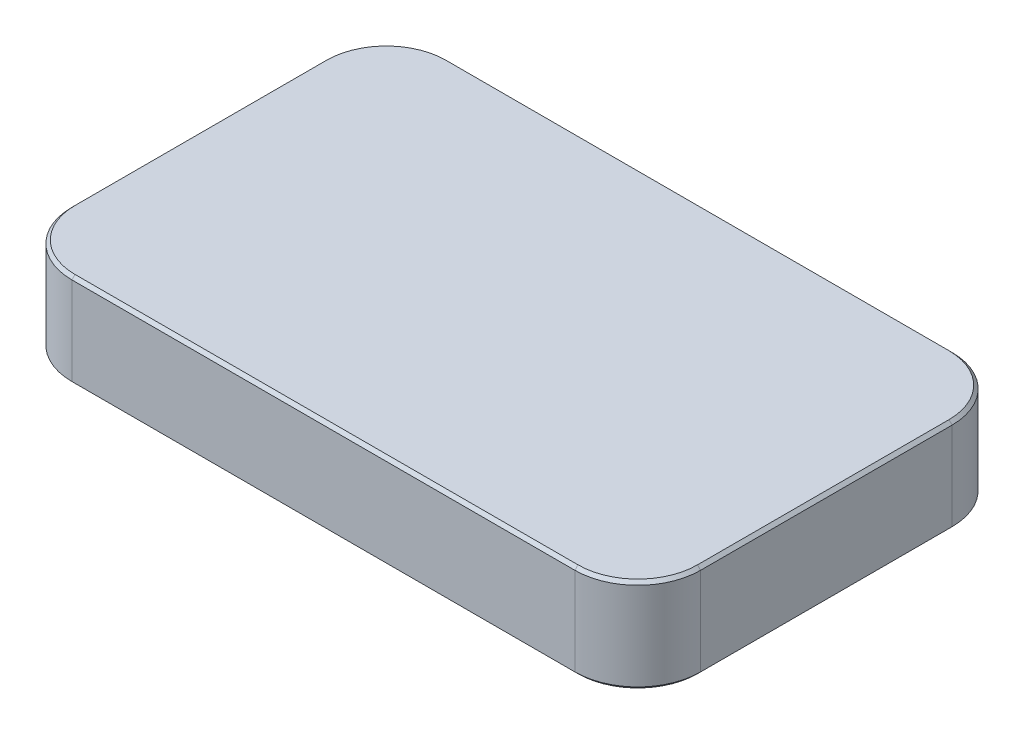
ISO-10303-21;
HEADER;
FILE_DESCRIPTION(('STEP AP214'),'2;1');
FILE_NAME('part.step','',(''),(''),'','','');
FILE_SCHEMA(('AUTOMOTIVE_DESIGN { 1 0 10303 214 1 1 1 1 }'));
ENDSEC;
DATA;
#1=APPLICATION_CONTEXT('core data for automotive mechanical design processes');
#2=APPLICATION_PROTOCOL_DEFINITION('international standard','automotive_design',2000,#1);
#3=PRODUCT_CONTEXT('',#1,'mechanical');
#4=PRODUCT('Part','Part','',(#3));
#5=PRODUCT_RELATED_PRODUCT_CATEGORY('part','',(#4));
#6=PRODUCT_DEFINITION_FORMATION('','',#4);
#7=PRODUCT_DEFINITION_CONTEXT('part definition',#1,'design');
#8=PRODUCT_DEFINITION('design','',#6,#7);
#9=PRODUCT_DEFINITION_SHAPE('','',#8);
#10=(LENGTH_UNIT() NAMED_UNIT(*) SI_UNIT(.MILLI.,.METRE.));
#11=(NAMED_UNIT(*) PLANE_ANGLE_UNIT() SI_UNIT($,.RADIAN.));
#12=(NAMED_UNIT(*) SI_UNIT($,.STERADIAN.) SOLID_ANGLE_UNIT());
#13=UNCERTAINTY_MEASURE_WITH_UNIT(LENGTH_MEASURE(1.E-05),#10,'distance_accuracy_value','');
#14=(GEOMETRIC_REPRESENTATION_CONTEXT(3) GLOBAL_UNCERTAINTY_ASSIGNED_CONTEXT((#13)) GLOBAL_UNIT_ASSIGNED_CONTEXT((#10,
#11,#12)) REPRESENTATION_CONTEXT('',''));
#15=CARTESIAN_POINT('',(0.,0.,0.));
#16=DIRECTION('',(0.,0.,1.));
#17=DIRECTION('',(1.,0.,0.));
#18=AXIS2_PLACEMENT_3D('',#15,#16,#17);
#19=CARTESIAN_POINT('',(-63.5,19.05,-38.1));
#20=DIRECTION('',(1.,0.,0.));
#21=DIRECTION('',(0.,0.,-1.));
#22=AXIS2_PLACEMENT_3D('',#19,#20,#21);
#23=PLANE('',#22);
#24=DIRECTION('',(0.,-1.,0.));
#25=VECTOR('',#24,1.);
#26=CARTESIAN_POINT('',(-63.5,19.05,-25.4));
#27=LINE('',#26,#25);
#28=CARTESIAN_POINT('',(-63.5,18.415,-25.4));
#29=VERTEX_POINT('',#28);
#30=CARTESIAN_POINT('',(-63.5,0.635000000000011,-25.4));
#31=VERTEX_POINT('',#30);
#32=EDGE_CURVE('E277',#29,#31,#27,.T.);
#33=ORIENTED_EDGE('',*,*,#32,.T.);
#34=DIRECTION('',(0.,0.,1.));
#35=VECTOR('',#34,1.);
#36=CARTESIAN_POINT('',(-63.5,0.635000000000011,-38.1));
#37=LINE('',#36,#35);
#38=CARTESIAN_POINT('',(-63.5,0.635000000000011,25.4));
#39=VERTEX_POINT('',#38);
#40=EDGE_CURVE('E205',#31,#39,#37,.T.);
#41=ORIENTED_EDGE('',*,*,#40,.T.);
#42=DIRECTION('',(0.,-1.,0.));
#43=VECTOR('',#42,1.);
#44=CARTESIAN_POINT('',(-63.5,19.05,25.4));
#45=LINE('',#44,#43);
#46=CARTESIAN_POINT('',(-63.5,18.415,25.4));
#47=VERTEX_POINT('',#46);
#48=EDGE_CURVE('E236',#39,#47,#45,.F.);
#49=ORIENTED_EDGE('',*,*,#48,.T.);
#50=DIRECTION('',(0.,0.,-1.));
#51=VECTOR('',#50,1.);
#52=CARTESIAN_POINT('',(-63.5,18.415,-25.4));
#53=LINE('',#52,#51);
#54=EDGE_CURVE('E203',#47,#29,#53,.T.);
#55=ORIENTED_EDGE('',*,*,#54,.T.);
#56=EDGE_LOOP('',(#33,#41,#49,#55));
#57=FACE_BOUND('',#56,.T.);
#58=ADVANCED_FACE('F31',(#57),#23,.F.);
#59=CARTESIAN_POINT('',(-63.5,19.05,38.1));
#60=DIRECTION('',(0.,0.,-1.));
#61=DIRECTION('',(-1.,0.,0.));
#62=AXIS2_PLACEMENT_3D('',#59,#60,#61);
#63=PLANE('',#62);
#64=DIRECTION('',(0.,-1.,0.));
#65=VECTOR('',#64,1.);
#66=CARTESIAN_POINT('',(-50.8,19.05,38.1));
#67=LINE('',#66,#65);
#68=CARTESIAN_POINT('',(-50.8,18.415,38.1));
#69=VERTEX_POINT('',#68);
#70=CARTESIAN_POINT('',(-50.8,0.635000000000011,38.1));
#71=VERTEX_POINT('',#70);
#72=EDGE_CURVE('E164',#69,#71,#67,.T.);
#73=ORIENTED_EDGE('',*,*,#72,.T.);
#74=DIRECTION('',(1.,0.,0.));
#75=VECTOR('',#74,1.);
#76=CARTESIAN_POINT('',(-63.5,0.635000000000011,38.1));
#77=LINE('',#76,#75);
#78=CARTESIAN_POINT('',(50.8,0.635000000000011,38.1));
#79=VERTEX_POINT('',#78);
#80=EDGE_CURVE('E180',#71,#79,#77,.T.);
#81=ORIENTED_EDGE('',*,*,#80,.T.);
#82=DIRECTION('',(0.,-1.,0.));
#83=VECTOR('',#82,1.);
#84=CARTESIAN_POINT('',(50.8,19.05,38.1));
#85=LINE('',#84,#83);
#86=CARTESIAN_POINT('',(50.8,18.415,38.1));
#87=VERTEX_POINT('',#86);
#88=EDGE_CURVE('E293',#79,#87,#85,.F.);
#89=ORIENTED_EDGE('',*,*,#88,.T.);
#90=DIRECTION('',(-1.,0.,0.));
#91=VECTOR('',#90,1.);
#92=CARTESIAN_POINT('',(-50.8,18.415,38.1));
#93=LINE('',#92,#91);
#94=EDGE_CURVE('E178',#87,#69,#93,.T.);
#95=ORIENTED_EDGE('',*,*,#94,.T.);
#96=EDGE_LOOP('',(#73,#81,#89,#95));
#97=FACE_BOUND('',#96,.T.);
#98=ADVANCED_FACE('F315',(#97),#63,.F.);
#99=CARTESIAN_POINT('',(63.5,19.05,-38.1));
#100=DIRECTION('',(-1.,0.,0.));
#101=DIRECTION('',(0.,0.,1.));
#102=AXIS2_PLACEMENT_3D('',#99,#100,#101);
#103=PLANE('',#102);
#104=DIRECTION('',(0.,-1.,0.));
#105=VECTOR('',#104,1.);
#106=CARTESIAN_POINT('',(63.5,19.05,25.4));
#107=LINE('',#106,#105);
#108=CARTESIAN_POINT('',(63.5,18.415,25.4));
#109=VERTEX_POINT('',#108);
#110=CARTESIAN_POINT('',(63.5,0.635000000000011,25.4));
#111=VERTEX_POINT('',#110);
#112=EDGE_CURVE('E287',#109,#111,#107,.T.);
#113=ORIENTED_EDGE('',*,*,#112,.T.);
#114=DIRECTION('',(0.,0.,-1.));
#115=VECTOR('',#114,1.);
#116=CARTESIAN_POINT('',(63.5,0.635000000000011,-38.1));
#117=LINE('',#116,#115);
#118=CARTESIAN_POINT('',(63.5,0.635000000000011,-25.4));
#119=VERTEX_POINT('',#118);
#120=EDGE_CURVE('E188',#111,#119,#117,.T.);
#121=ORIENTED_EDGE('',*,*,#120,.T.);
#122=DIRECTION('',(0.,-1.,0.));
#123=VECTOR('',#122,1.);
#124=CARTESIAN_POINT('',(63.5,19.05,-25.4));
#125=LINE('',#124,#123);
#126=CARTESIAN_POINT('',(63.5,18.415,-25.4));
#127=VERTEX_POINT('',#126);
#128=EDGE_CURVE('E290',#119,#127,#125,.F.);
#129=ORIENTED_EDGE('',*,*,#128,.T.);
#130=DIRECTION('',(0.,0.,1.));
#131=VECTOR('',#130,1.);
#132=CARTESIAN_POINT('',(63.5,18.415,25.4));
#133=LINE('',#132,#131);
#134=EDGE_CURVE('E186',#127,#109,#133,.T.);
#135=ORIENTED_EDGE('',*,*,#134,.T.);
#136=EDGE_LOOP('',(#113,#121,#129,#135));
#137=FACE_BOUND('',#136,.T.);
#138=ADVANCED_FACE('F359',(#137),#103,.F.);
#139=CARTESIAN_POINT('',(-63.5,19.05,-38.1));
#140=DIRECTION('',(0.,0.,1.));
#141=DIRECTION('',(1.,0.,0.));
#142=AXIS2_PLACEMENT_3D('',#139,#140,#141);
#143=PLANE('',#142);
#144=DIRECTION('',(0.,-1.,0.));
#145=VECTOR('',#144,1.);
#146=CARTESIAN_POINT('',(50.8,19.05,-38.1));
#147=LINE('',#146,#145);
#148=CARTESIAN_POINT('',(50.8,18.415,-38.1));
#149=VERTEX_POINT('',#148);
#150=CARTESIAN_POINT('',(50.8,0.635000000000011,-38.1));
#151=VERTEX_POINT('',#150);
#152=EDGE_CURVE('E279',#149,#151,#147,.T.);
#153=ORIENTED_EDGE('',*,*,#152,.T.);
#154=DIRECTION('',(-1.,0.,0.));
#155=VECTOR('',#154,1.);
#156=CARTESIAN_POINT('',(-63.5,0.635000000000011,-38.1));
#157=LINE('',#156,#155);
#158=CARTESIAN_POINT('',(-50.8,0.635000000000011,-38.1));
#159=VERTEX_POINT('',#158);
#160=EDGE_CURVE('E197',#151,#159,#157,.T.);
#161=ORIENTED_EDGE('',*,*,#160,.T.);
#162=DIRECTION('',(0.,-1.,0.));
#163=VECTOR('',#162,1.);
#164=CARTESIAN_POINT('',(-50.8,19.05,-38.1));
#165=LINE('',#164,#163);
#166=CARTESIAN_POINT('',(-50.8,18.415,-38.1));
#167=VERTEX_POINT('',#166);
#168=EDGE_CURVE('E284',#159,#167,#165,.F.);
#169=ORIENTED_EDGE('',*,*,#168,.T.);
#170=DIRECTION('',(1.,0.,0.));
#171=VECTOR('',#170,1.);
#172=CARTESIAN_POINT('',(50.8,18.415,-38.1));
#173=LINE('',#172,#171);
#174=EDGE_CURVE('E195',#167,#149,#173,.T.);
#175=ORIENTED_EDGE('',*,*,#174,.T.);
#176=EDGE_LOOP('',(#153,#161,#169,#175));
#177=FACE_BOUND('',#176,.T.);
#178=ADVANCED_FACE('F343',(#177),#143,.F.);
#179=CARTESIAN_POINT('',(-63.5,19.05,38.1));
#180=DIRECTION('',(0.,1.,0.));
#181=DIRECTION('',(0.,0.,1.));
#182=AXIS2_PLACEMENT_3D('',#179,#180,#181);
#183=PLANE('',#182);
#184=DIRECTION('',(0.,0.,-1.));
#185=VECTOR('',#184,1.);
#186=CARTESIAN_POINT('',(62.865,19.05,-25.4));
#187=LINE('',#186,#185);
#188=CARTESIAN_POINT('',(62.865,19.05,25.4));
#189=VERTEX_POINT('',#188);
#190=CARTESIAN_POINT('',(62.865,19.05,-25.4));
#191=VERTEX_POINT('',#190);
#192=EDGE_CURVE('E40',#189,#191,#187,.T.);
#193=ORIENTED_EDGE('',*,*,#192,.T.);
#194=CARTESIAN_POINT('',(50.8,19.05,-25.4));
#195=DIRECTION('',(0.,1.,0.));
#196=DIRECTION('',(0.,0.,1.));
#197=AXIS2_PLACEMENT_3D('',#194,#195,#196);
#198=CIRCLE('',#197,12.065);
#199=CARTESIAN_POINT('',(50.8,19.05,-37.465));
#200=VERTEX_POINT('',#199);
#201=EDGE_CURVE('E11',#191,#200,#198,.T.);
#202=ORIENTED_EDGE('',*,*,#201,.T.);
#203=DIRECTION('',(-1.,0.,0.));
#204=VECTOR('',#203,1.);
#205=CARTESIAN_POINT('',(-50.8,19.05,-37.465));
#206=LINE('',#205,#204);
#207=CARTESIAN_POINT('',(-50.8,19.05,-37.465));
#208=VERTEX_POINT('',#207);
#209=EDGE_CURVE('E207',#200,#208,#206,.T.);
#210=ORIENTED_EDGE('',*,*,#209,.T.);
#211=CARTESIAN_POINT('',(-50.8,19.05,-25.4));
#212=DIRECTION('',(0.,1.,0.));
#213=DIRECTION('',(0.,0.,1.));
#214=AXIS2_PLACEMENT_3D('',#211,#212,#213);
#215=CIRCLE('',#214,12.065);
#216=CARTESIAN_POINT('',(-62.865,19.05,-25.4));
#217=VERTEX_POINT('',#216);
#218=EDGE_CURVE('E209',#208,#217,#215,.T.);
#219=ORIENTED_EDGE('',*,*,#218,.T.);
#220=DIRECTION('',(0.,0.,1.));
#221=VECTOR('',#220,1.);
#222=CARTESIAN_POINT('',(-62.865,19.05,25.4));
#223=LINE('',#222,#221);
#224=CARTESIAN_POINT('',(-62.865,19.05,25.4));
#225=VERTEX_POINT('',#224);
#226=EDGE_CURVE('E211',#217,#225,#223,.T.);
#227=ORIENTED_EDGE('',*,*,#226,.T.);
#228=CARTESIAN_POINT('',(-50.8,19.05,25.4));
#229=DIRECTION('',(0.,1.,0.));
#230=DIRECTION('',(0.,0.,1.));
#231=AXIS2_PLACEMENT_3D('',#228,#229,#230);
#232=CIRCLE('',#231,12.065);
#233=CARTESIAN_POINT('',(-50.8,19.05,37.465));
#234=VERTEX_POINT('',#233);
#235=EDGE_CURVE('E213',#225,#234,#232,.T.);
#236=ORIENTED_EDGE('',*,*,#235,.T.);
#237=DIRECTION('',(1.,0.,0.));
#238=VECTOR('',#237,1.);
#239=CARTESIAN_POINT('',(50.8,19.05,37.465));
#240=LINE('',#239,#238);
#241=CARTESIAN_POINT('',(50.8,19.05,37.465));
#242=VERTEX_POINT('',#241);
#243=EDGE_CURVE('E215',#234,#242,#240,.T.);
#244=ORIENTED_EDGE('',*,*,#243,.T.);
#245=CARTESIAN_POINT('',(50.8,19.05,25.4));
#246=DIRECTION('',(0.,1.,0.));
#247=DIRECTION('',(0.,0.,1.));
#248=AXIS2_PLACEMENT_3D('',#245,#246,#247);
#249=CIRCLE('',#248,12.065);
#250=EDGE_CURVE('E51',#242,#189,#249,.T.);
#251=ORIENTED_EDGE('',*,*,#250,.T.);
#252=EDGE_LOOP('',(#193,#202,#210,#219,#227,#236,#244,#251));
#253=FACE_BOUND('',#252,.T.);
#254=ADVANCED_FACE('F331',(#253),#183,.T.);
#255=CARTESIAN_POINT('',(-63.5,0.,38.1));
#256=DIRECTION('',(0.,1.,0.));
#257=DIRECTION('',(0.,0.,1.));
#258=AXIS2_PLACEMENT_3D('',#255,#256,#257);
#259=PLANE('',#258);
#260=DIRECTION('',(-1.,0.,0.));
#261=VECTOR('',#260,1.);
#262=CARTESIAN_POINT('',(-63.5,0.,37.465));
#263=LINE('',#262,#261);
#264=CARTESIAN_POINT('',(50.8,0.,37.465));
#265=VERTEX_POINT('',#264);
#266=CARTESIAN_POINT('',(-50.8,0.,37.465));
#267=VERTEX_POINT('',#266);
#268=EDGE_CURVE('E168',#265,#267,#263,.T.);
#269=ORIENTED_EDGE('',*,*,#268,.T.);
#270=CARTESIAN_POINT('',(-50.8,0.,25.4));
#271=DIRECTION('',(0.,1.,0.));
#272=DIRECTION('',(0.,0.,1.));
#273=AXIS2_PLACEMENT_3D('',#270,#271,#272);
#274=CIRCLE('',#273,12.065);
#275=CARTESIAN_POINT('',(-62.865,0.,25.4));
#276=VERTEX_POINT('',#275);
#277=EDGE_CURVE('E149',#267,#276,#274,.F.);
#278=ORIENTED_EDGE('',*,*,#277,.T.);
#279=DIRECTION('',(0.,0.,-1.));
#280=VECTOR('',#279,1.);
#281=CARTESIAN_POINT('',(-62.865,0.,38.1));
#282=LINE('',#281,#280);
#283=CARTESIAN_POINT('',(-62.865,0.,-25.4));
#284=VERTEX_POINT('',#283);
#285=EDGE_CURVE('E157',#276,#284,#282,.T.);
#286=ORIENTED_EDGE('',*,*,#285,.T.);
#287=CARTESIAN_POINT('',(-50.8,0.,-25.4));
#288=DIRECTION('',(0.,1.,0.));
#289=DIRECTION('',(0.,0.,1.));
#290=AXIS2_PLACEMENT_3D('',#287,#288,#289);
#291=CIRCLE('',#290,12.065);
#292=CARTESIAN_POINT('',(-50.8,0.,-37.465));
#293=VERTEX_POINT('',#292);
#294=EDGE_CURVE('E163',#284,#293,#291,.F.);
#295=ORIENTED_EDGE('',*,*,#294,.T.);
#296=DIRECTION('',(1.,0.,0.));
#297=VECTOR('',#296,1.);
#298=CARTESIAN_POINT('',(-63.5,0.,-37.465));
#299=LINE('',#298,#297);
#300=CARTESIAN_POINT('',(50.8,0.,-37.465));
#301=VERTEX_POINT('',#300);
#302=EDGE_CURVE('E298',#293,#301,#299,.T.);
#303=ORIENTED_EDGE('',*,*,#302,.T.);
#304=CARTESIAN_POINT('',(50.8,0.,-25.4));
#305=DIRECTION('',(0.,1.,0.));
#306=DIRECTION('',(0.,0.,1.));
#307=AXIS2_PLACEMENT_3D('',#304,#305,#306);
#308=CIRCLE('',#307,12.065);
#309=CARTESIAN_POINT('',(62.865,0.,-25.4));
#310=VERTEX_POINT('',#309);
#311=EDGE_CURVE('E300',#301,#310,#308,.F.);
#312=ORIENTED_EDGE('',*,*,#311,.T.);
#313=DIRECTION('',(0.,0.,1.));
#314=VECTOR('',#313,1.);
#315=CARTESIAN_POINT('',(62.865,0.,38.1));
#316=LINE('',#315,#314);
#317=CARTESIAN_POINT('',(62.865,0.,25.4));
#318=VERTEX_POINT('',#317);
#319=EDGE_CURVE('E302',#310,#318,#316,.T.);
#320=ORIENTED_EDGE('',*,*,#319,.T.);
#321=CARTESIAN_POINT('',(50.8,0.,25.4));
#322=DIRECTION('',(0.,1.,0.));
#323=DIRECTION('',(0.,0.,1.));
#324=AXIS2_PLACEMENT_3D('',#321,#322,#323);
#325=CIRCLE('',#324,12.065);
#326=EDGE_CURVE('E173',#318,#265,#325,.F.);
#327=ORIENTED_EDGE('',*,*,#326,.T.);
#328=EDGE_LOOP('',(#269,#278,#286,#295,#303,#312,#320,#327));
#329=FACE_BOUND('',#328,.T.);
#330=ADVANCED_FACE('F166',(#329),#259,.F.);
#331=CARTESIAN_POINT('',(-50.8,19.05,-25.4));
#332=DIRECTION('',(0.,-1.,0.));
#333=DIRECTION('',(0.,0.,-1.));
#334=AXIS2_PLACEMENT_3D('',#331,#332,#333);
#335=CYLINDRICAL_SURFACE('',#334,12.7);
#336=ORIENTED_EDGE('',*,*,#168,.F.);
#337=CARTESIAN_POINT('',(-50.8,0.635000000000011,-25.4));
#338=DIRECTION('',(0.,1.,0.));
#339=DIRECTION('',(0.,0.,1.));
#340=AXIS2_PLACEMENT_3D('',#337,#338,#339);
#341=CIRCLE('',#340,12.7);
#342=EDGE_CURVE('E201',#159,#31,#341,.T.);
#343=ORIENTED_EDGE('',*,*,#342,.T.);
#344=ORIENTED_EDGE('',*,*,#32,.F.);
#345=CARTESIAN_POINT('',(-50.8,18.415,-25.4));
#346=DIRECTION('',(0.,1.,0.));
#347=DIRECTION('',(0.,0.,1.));
#348=AXIS2_PLACEMENT_3D('',#345,#346,#347);
#349=CIRCLE('',#348,12.7);
#350=EDGE_CURVE('E199',#29,#167,#349,.F.);
#351=ORIENTED_EDGE('',*,*,#350,.T.);
#352=EDGE_LOOP('',(#336,#343,#344,#351));
#353=FACE_BOUND('',#352,.T.);
#354=ADVANCED_FACE('F373',(#353),#335,.T.);
#355=CARTESIAN_POINT('',(50.8,19.05,-25.4));
#356=DIRECTION('',(0.,-1.,0.));
#357=DIRECTION('',(0.,0.,-1.));
#358=AXIS2_PLACEMENT_3D('',#355,#356,#357);
#359=CYLINDRICAL_SURFACE('',#358,12.7);
#360=ORIENTED_EDGE('',*,*,#128,.F.);
#361=CARTESIAN_POINT('',(50.8,0.635000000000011,-25.4));
#362=DIRECTION('',(0.,1.,0.));
#363=DIRECTION('',(0.,0.,1.));
#364=AXIS2_PLACEMENT_3D('',#361,#362,#363);
#365=CIRCLE('',#364,12.7);
#366=EDGE_CURVE('E193',#119,#151,#365,.T.);
#367=ORIENTED_EDGE('',*,*,#366,.T.);
#368=ORIENTED_EDGE('',*,*,#152,.F.);
#369=CARTESIAN_POINT('',(50.8,18.415,-25.4));
#370=DIRECTION('',(0.,1.,0.));
#371=DIRECTION('',(0.,0.,1.));
#372=AXIS2_PLACEMENT_3D('',#369,#370,#371);
#373=CIRCLE('',#372,12.7);
#374=EDGE_CURVE('E190',#149,#127,#373,.F.);
#375=ORIENTED_EDGE('',*,*,#374,.T.);
#376=EDGE_LOOP('',(#360,#367,#368,#375));
#377=FACE_BOUND('',#376,.T.);
#378=ADVANCED_FACE('F348',(#377),#359,.T.);
#379=CARTESIAN_POINT('',(-50.8,19.05,25.4));
#380=DIRECTION('',(0.,-1.,0.));
#381=DIRECTION('',(0.,0.,-1.));
#382=AXIS2_PLACEMENT_3D('',#379,#380,#381);
#383=CYLINDRICAL_SURFACE('',#382,12.7);
#384=ORIENTED_EDGE('',*,*,#48,.F.);
#385=CARTESIAN_POINT('',(-50.8,0.635000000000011,25.4));
#386=DIRECTION('',(0.,1.,0.));
#387=DIRECTION('',(0.,0.,1.));
#388=AXIS2_PLACEMENT_3D('',#385,#386,#387);
#389=CIRCLE('',#388,12.7);
#390=EDGE_CURVE('E151',#39,#71,#389,.T.);
#391=ORIENTED_EDGE('',*,*,#390,.T.);
#392=ORIENTED_EDGE('',*,*,#72,.F.);
#393=CARTESIAN_POINT('',(-50.8,18.415,25.4));
#394=DIRECTION('',(0.,1.,0.));
#395=DIRECTION('',(0.,0.,1.));
#396=AXIS2_PLACEMENT_3D('',#393,#394,#395);
#397=CIRCLE('',#396,12.7);
#398=EDGE_CURVE('E170',#69,#47,#397,.F.);
#399=ORIENTED_EDGE('',*,*,#398,.T.);
#400=EDGE_LOOP('',(#384,#391,#392,#399));
#401=FACE_BOUND('',#400,.T.);
#402=ADVANCED_FACE('F272',(#401),#383,.T.);
#403=CARTESIAN_POINT('',(50.8,19.05,25.4));
#404=DIRECTION('',(0.,-1.,0.));
#405=DIRECTION('',(0.,0.,-1.));
#406=AXIS2_PLACEMENT_3D('',#403,#404,#405);
#407=CYLINDRICAL_SURFACE('',#406,12.7);
#408=ORIENTED_EDGE('',*,*,#88,.F.);
#409=CARTESIAN_POINT('',(50.8,0.635000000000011,25.4));
#410=DIRECTION('',(0.,1.,0.));
#411=DIRECTION('',(0.,0.,1.));
#412=AXIS2_PLACEMENT_3D('',#409,#410,#411);
#413=CIRCLE('',#412,12.7);
#414=EDGE_CURVE('E184',#79,#111,#413,.T.);
#415=ORIENTED_EDGE('',*,*,#414,.T.);
#416=ORIENTED_EDGE('',*,*,#112,.F.);
#417=CARTESIAN_POINT('',(50.8,18.415,25.4));
#418=DIRECTION('',(0.,1.,0.));
#419=DIRECTION('',(0.,0.,1.));
#420=AXIS2_PLACEMENT_3D('',#417,#418,#419);
#421=CIRCLE('',#420,12.7);
#422=EDGE_CURVE('E182',#109,#87,#421,.F.);
#423=ORIENTED_EDGE('',*,*,#422,.T.);
#424=EDGE_LOOP('',(#408,#415,#416,#423));
#425=FACE_BOUND('',#424,.T.);
#426=ADVANCED_FACE('F317',(#425),#407,.T.);
#427=CARTESIAN_POINT('',(50.8,0.,-25.4));
#428=DIRECTION('',(0.,1.,0.));
#429=DIRECTION('',(0.,0.,1.));
#430=AXIS2_PLACEMENT_3D('',#427,#428,#429);
#431=CONICAL_SURFACE('',#430,12.065,0.785398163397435);
#432=DIRECTION('',(0.,-0.707106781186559,0.707106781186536));
#433=VECTOR('',#432,1.);
#434=CARTESIAN_POINT('',(50.8,0.635000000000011,-38.1));
#435=LINE('',#434,#433);
#436=EDGE_CURVE('E230',#151,#301,#435,.T.);
#437=ORIENTED_EDGE('',*,*,#436,.F.);
#438=ORIENTED_EDGE('',*,*,#366,.F.);
#439=DIRECTION('',(0.70710678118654,0.707106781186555,0.));
#440=VECTOR('',#439,1.);
#441=CARTESIAN_POINT('',(62.865,0.,-25.4));
#442=LINE('',#441,#440);
#443=EDGE_CURVE('E233',#310,#119,#442,.T.);
#444=ORIENTED_EDGE('',*,*,#443,.F.);
#445=ORIENTED_EDGE('',*,*,#311,.F.);
#446=EDGE_LOOP('',(#437,#438,#444,#445));
#447=FACE_BOUND('',#446,.T.);
#448=ADVANCED_FACE('F352',(#447),#431,.T.);
#449=CARTESIAN_POINT('',(63.5,0.635000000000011,-38.1));
#450=DIRECTION('',(-0.707106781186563,0.707106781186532,0.));
#451=DIRECTION('',(-0.707106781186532,-0.707106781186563,0.));
#452=AXIS2_PLACEMENT_3D('',#449,#450,#451);
#453=PLANE('',#452);
#454=ORIENTED_EDGE('',*,*,#443,.T.);
#455=ORIENTED_EDGE('',*,*,#120,.F.);
#456=DIRECTION('',(0.707106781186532,0.707106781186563,0.));
#457=VECTOR('',#456,1.);
#458=CARTESIAN_POINT('',(62.865,0.,25.4));
#459=LINE('',#458,#457);
#460=EDGE_CURVE('E227',#318,#111,#459,.T.);
#461=ORIENTED_EDGE('',*,*,#460,.F.);
#462=ORIENTED_EDGE('',*,*,#319,.F.);
#463=EDGE_LOOP('',(#454,#455,#461,#462));
#464=FACE_BOUND('',#463,.T.);
#465=ADVANCED_FACE('F357',(#464),#453,.F.);
#466=CARTESIAN_POINT('',(-63.5,0.635000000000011,-38.1));
#467=DIRECTION('',(0.,0.70710678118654,0.707106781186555));
#468=DIRECTION('',(0.,-0.707106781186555,0.70710678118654));
#469=AXIS2_PLACEMENT_3D('',#466,#467,#468);
#470=PLANE('',#469);
#471=ORIENTED_EDGE('',*,*,#436,.T.);
#472=ORIENTED_EDGE('',*,*,#302,.F.);
#473=DIRECTION('',(0.,-0.707106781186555,0.70710678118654));
#474=VECTOR('',#473,1.);
#475=CARTESIAN_POINT('',(-50.8,0.635000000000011,-38.1));
#476=LINE('',#475,#474);
#477=EDGE_CURVE('E224',#159,#293,#476,.T.);
#478=ORIENTED_EDGE('',*,*,#477,.F.);
#479=ORIENTED_EDGE('',*,*,#160,.F.);
#480=EDGE_LOOP('',(#471,#472,#478,#479));
#481=FACE_BOUND('',#480,.T.);
#482=ADVANCED_FACE('F395',(#481),#470,.F.);
#483=CARTESIAN_POINT('',(50.8,0.,25.4));
#484=DIRECTION('',(0.,1.,0.));
#485=DIRECTION('',(0.,0.,1.));
#486=AXIS2_PLACEMENT_3D('',#483,#484,#485);
#487=CONICAL_SURFACE('',#486,12.065,0.785398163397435);
#488=ORIENTED_EDGE('',*,*,#460,.T.);
#489=ORIENTED_EDGE('',*,*,#414,.F.);
#490=DIRECTION('',(0.,0.707106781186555,0.70710678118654));
#491=VECTOR('',#490,1.);
#492=CARTESIAN_POINT('',(50.8,0.,37.465));
#493=LINE('',#492,#491);
#494=EDGE_CURVE('E221',#265,#79,#493,.T.);
#495=ORIENTED_EDGE('',*,*,#494,.F.);
#496=ORIENTED_EDGE('',*,*,#326,.F.);
#497=EDGE_LOOP('',(#488,#489,#495,#496));
#498=FACE_BOUND('',#497,.T.);
#499=ADVANCED_FACE('F309',(#498),#487,.T.);
#500=CARTESIAN_POINT('',(-50.8,0.,-25.4));
#501=DIRECTION('',(0.,1.,0.));
#502=DIRECTION('',(0.,0.,1.));
#503=AXIS2_PLACEMENT_3D('',#500,#501,#502);
#504=CONICAL_SURFACE('',#503,12.065,0.78539816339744);
#505=ORIENTED_EDGE('',*,*,#477,.T.);
#506=ORIENTED_EDGE('',*,*,#294,.F.);
#507=DIRECTION('',(0.70710678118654,-0.707106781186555,0.));
#508=VECTOR('',#507,1.);
#509=CARTESIAN_POINT('',(-63.5,0.635000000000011,-25.4));
#510=LINE('',#509,#508);
#511=EDGE_CURVE('E160',#31,#284,#510,.T.);
#512=ORIENTED_EDGE('',*,*,#511,.F.);
#513=ORIENTED_EDGE('',*,*,#342,.F.);
#514=EDGE_LOOP('',(#505,#506,#512,#513));
#515=FACE_BOUND('',#514,.T.);
#516=ADVANCED_FACE('F389',(#515),#504,.T.);
#517=CARTESIAN_POINT('',(-63.5,0.635000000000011,38.1));
#518=DIRECTION('',(0.,0.70710678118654,-0.707106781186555));
#519=DIRECTION('',(0.,0.707106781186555,0.70710678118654));
#520=AXIS2_PLACEMENT_3D('',#517,#518,#519);
#521=PLANE('',#520);
#522=ORIENTED_EDGE('',*,*,#494,.T.);
#523=ORIENTED_EDGE('',*,*,#80,.F.);
#524=DIRECTION('',(0.,0.707106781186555,0.70710678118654));
#525=VECTOR('',#524,1.);
#526=CARTESIAN_POINT('',(-50.8,0.,37.465));
#527=LINE('',#526,#525);
#528=EDGE_CURVE('E154',#267,#71,#527,.T.);
#529=ORIENTED_EDGE('',*,*,#528,.F.);
#530=ORIENTED_EDGE('',*,*,#268,.F.);
#531=EDGE_LOOP('',(#522,#523,#529,#530));
#532=FACE_BOUND('',#531,.T.);
#533=ADVANCED_FACE('F312',(#532),#521,.F.);
#534=CARTESIAN_POINT('',(-63.5,0.635000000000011,-38.1));
#535=DIRECTION('',(0.707106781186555,0.70710678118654,0.));
#536=DIRECTION('',(-0.70710678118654,0.707106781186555,0.));
#537=AXIS2_PLACEMENT_3D('',#534,#535,#536);
#538=PLANE('',#537);
#539=ORIENTED_EDGE('',*,*,#511,.T.);
#540=ORIENTED_EDGE('',*,*,#285,.F.);
#541=DIRECTION('',(0.70710678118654,-0.707106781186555,0.));
#542=VECTOR('',#541,1.);
#543=CARTESIAN_POINT('',(-63.5,0.635000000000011,25.4));
#544=LINE('',#543,#542);
#545=EDGE_CURVE('E145',#39,#276,#544,.T.);
#546=ORIENTED_EDGE('',*,*,#545,.F.);
#547=ORIENTED_EDGE('',*,*,#40,.F.);
#548=EDGE_LOOP('',(#539,#540,#546,#547));
#549=FACE_BOUND('',#548,.T.);
#550=ADVANCED_FACE('F158',(#549),#538,.F.);
#551=CARTESIAN_POINT('',(-50.8,0.,25.4));
#552=DIRECTION('',(0.,1.,0.));
#553=DIRECTION('',(0.,0.,1.));
#554=AXIS2_PLACEMENT_3D('',#551,#552,#553);
#555=CONICAL_SURFACE('',#554,12.065,0.785398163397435);
#556=ORIENTED_EDGE('',*,*,#528,.T.);
#557=ORIENTED_EDGE('',*,*,#390,.F.);
#558=ORIENTED_EDGE('',*,*,#545,.T.);
#559=ORIENTED_EDGE('',*,*,#277,.F.);
#560=EDGE_LOOP('',(#556,#557,#558,#559));
#561=FACE_BOUND('',#560,.T.);
#562=ADVANCED_FACE('F147',(#561),#555,.T.);
#563=CARTESIAN_POINT('',(-50.8,19.05,25.4));
#564=DIRECTION('',(0.,-1.,0.));
#565=DIRECTION('',(0.,0.,-1.));
#566=AXIS2_PLACEMENT_3D('',#563,#564,#565);
#567=CONICAL_SURFACE('',#566,12.065,0.785398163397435);
#568=DIRECTION('',(0.70710678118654,0.707106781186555,0.));
#569=VECTOR('',#568,1.);
#570=CARTESIAN_POINT('',(-63.5,18.415,25.4));
#571=LINE('',#570,#569);
#572=EDGE_CURVE('E252',#47,#225,#571,.T.);
#573=ORIENTED_EDGE('',*,*,#572,.F.);
#574=ORIENTED_EDGE('',*,*,#398,.F.);
#575=DIRECTION('',(0.,-0.707106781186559,0.707106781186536));
#576=VECTOR('',#575,1.);
#577=CARTESIAN_POINT('',(-50.8,19.05,37.465));
#578=LINE('',#577,#576);
#579=EDGE_CURVE('E35',#234,#69,#578,.T.);
#580=ORIENTED_EDGE('',*,*,#579,.F.);
#581=ORIENTED_EDGE('',*,*,#235,.F.);
#582=EDGE_LOOP('',(#573,#574,#580,#581));
#583=FACE_BOUND('',#582,.T.);
#584=ADVANCED_FACE('F33',(#583),#567,.T.);
#585=CARTESIAN_POINT('',(-63.5,19.05,37.465));
#586=DIRECTION('',(0.,0.70710678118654,0.707106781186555));
#587=DIRECTION('',(0.,-0.707106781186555,0.70710678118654));
#588=AXIS2_PLACEMENT_3D('',#585,#586,#587);
#589=PLANE('',#588);
#590=ORIENTED_EDGE('',*,*,#579,.T.);
#591=ORIENTED_EDGE('',*,*,#94,.F.);
#592=DIRECTION('',(0.,-0.707106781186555,0.70710678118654));
#593=VECTOR('',#592,1.);
#594=CARTESIAN_POINT('',(50.8,19.05,37.465));
#595=LINE('',#594,#593);
#596=EDGE_CURVE('E250',#242,#87,#595,.T.);
#597=ORIENTED_EDGE('',*,*,#596,.F.);
#598=ORIENTED_EDGE('',*,*,#243,.F.);
#599=EDGE_LOOP('',(#590,#591,#597,#598));
#600=FACE_BOUND('',#599,.T.);
#601=ADVANCED_FACE('F263',(#600),#589,.T.);
#602=CARTESIAN_POINT('',(-62.865,19.05,38.1));
#603=DIRECTION('',(-0.707106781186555,0.70710678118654,0.));
#604=DIRECTION('',(-0.70710678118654,-0.707106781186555,0.));
#605=AXIS2_PLACEMENT_3D('',#602,#603,#604);
#606=PLANE('',#605);
#607=ORIENTED_EDGE('',*,*,#572,.T.);
#608=ORIENTED_EDGE('',*,*,#226,.F.);
#609=DIRECTION('',(0.70710678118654,0.707106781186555,0.));
#610=VECTOR('',#609,1.);
#611=CARTESIAN_POINT('',(-63.5,18.415,-25.4));
#612=LINE('',#611,#610);
#613=EDGE_CURVE('E247',#29,#217,#612,.T.);
#614=ORIENTED_EDGE('',*,*,#613,.F.);
#615=ORIENTED_EDGE('',*,*,#54,.F.);
#616=EDGE_LOOP('',(#607,#608,#614,#615));
#617=FACE_BOUND('',#616,.T.);
#618=ADVANCED_FACE('F413',(#617),#606,.T.);
#619=CARTESIAN_POINT('',(50.8,19.05,25.4));
#620=DIRECTION('',(0.,-1.,0.));
#621=DIRECTION('',(0.,0.,-1.));
#622=AXIS2_PLACEMENT_3D('',#619,#620,#621);
#623=CONICAL_SURFACE('',#622,12.065,0.785398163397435);
#624=ORIENTED_EDGE('',*,*,#596,.T.);
#625=ORIENTED_EDGE('',*,*,#422,.F.);
#626=DIRECTION('',(0.70710678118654,-0.707106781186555,0.));
#627=VECTOR('',#626,1.);
#628=CARTESIAN_POINT('',(62.865,19.05,25.4));
#629=LINE('',#628,#627);
#630=EDGE_CURVE('E244',#189,#109,#629,.T.);
#631=ORIENTED_EDGE('',*,*,#630,.F.);
#632=ORIENTED_EDGE('',*,*,#250,.F.);
#633=EDGE_LOOP('',(#624,#625,#631,#632));
#634=FACE_BOUND('',#633,.T.);
#635=ADVANCED_FACE('F321',(#634),#623,.T.);
#636=CARTESIAN_POINT('',(-50.8,19.05,-25.4));
#637=DIRECTION('',(0.,-1.,0.));
#638=DIRECTION('',(0.,0.,-1.));
#639=AXIS2_PLACEMENT_3D('',#636,#637,#638);
#640=CONICAL_SURFACE('',#639,12.065,0.78539816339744);
#641=ORIENTED_EDGE('',*,*,#613,.T.);
#642=ORIENTED_EDGE('',*,*,#218,.F.);
#643=DIRECTION('',(0.,0.707106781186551,0.707106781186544));
#644=VECTOR('',#643,1.);
#645=CARTESIAN_POINT('',(-50.8,18.415,-38.1));
#646=LINE('',#645,#644);
#647=EDGE_CURVE('E241',#167,#208,#646,.T.);
#648=ORIENTED_EDGE('',*,*,#647,.F.);
#649=ORIENTED_EDGE('',*,*,#350,.F.);
#650=EDGE_LOOP('',(#641,#642,#648,#649));
#651=FACE_BOUND('',#650,.T.);
#652=ADVANCED_FACE('F336',(#651),#640,.T.);
#653=CARTESIAN_POINT('',(62.865,19.05,38.1));
#654=DIRECTION('',(0.707106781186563,0.707106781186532,0.));
#655=DIRECTION('',(-0.707106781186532,0.707106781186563,0.));
#656=AXIS2_PLACEMENT_3D('',#653,#654,#655);
#657=PLANE('',#656);
#658=ORIENTED_EDGE('',*,*,#630,.T.);
#659=ORIENTED_EDGE('',*,*,#134,.F.);
#660=DIRECTION('',(0.707106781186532,-0.707106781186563,0.));
#661=VECTOR('',#660,1.);
#662=CARTESIAN_POINT('',(62.865,19.05,-25.4));
#663=LINE('',#662,#661);
#664=EDGE_CURVE('E239',#191,#127,#663,.T.);
#665=ORIENTED_EDGE('',*,*,#664,.F.);
#666=ORIENTED_EDGE('',*,*,#192,.F.);
#667=EDGE_LOOP('',(#658,#659,#665,#666));
#668=FACE_BOUND('',#667,.T.);
#669=ADVANCED_FACE('F324',(#668),#657,.T.);
#670=CARTESIAN_POINT('',(-63.5,19.05,-37.465));
#671=DIRECTION('',(0.,0.70710678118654,-0.707106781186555));
#672=DIRECTION('',(0.,0.707106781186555,0.70710678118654));
#673=AXIS2_PLACEMENT_3D('',#670,#671,#672);
#674=PLANE('',#673);
#675=ORIENTED_EDGE('',*,*,#647,.T.);
#676=ORIENTED_EDGE('',*,*,#209,.F.);
#677=DIRECTION('',(0.,0.707106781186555,0.70710678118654));
#678=VECTOR('',#677,1.);
#679=CARTESIAN_POINT('',(50.8,18.415,-38.1));
#680=LINE('',#679,#678);
#681=EDGE_CURVE('E237',#149,#200,#680,.T.);
#682=ORIENTED_EDGE('',*,*,#681,.F.);
#683=ORIENTED_EDGE('',*,*,#174,.F.);
#684=EDGE_LOOP('',(#675,#676,#682,#683));
#685=FACE_BOUND('',#684,.T.);
#686=ADVANCED_FACE('F340',(#685),#674,.T.);
#687=CARTESIAN_POINT('',(50.8,19.05,-25.4));
#688=DIRECTION('',(0.,-1.,0.));
#689=DIRECTION('',(0.,0.,-1.));
#690=AXIS2_PLACEMENT_3D('',#687,#688,#689);
#691=CONICAL_SURFACE('',#690,12.065,0.785398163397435);
#692=ORIENTED_EDGE('',*,*,#664,.T.);
#693=ORIENTED_EDGE('',*,*,#374,.F.);
#694=ORIENTED_EDGE('',*,*,#681,.T.);
#695=ORIENTED_EDGE('',*,*,#201,.F.);
#696=EDGE_LOOP('',(#692,#693,#694,#695));
#697=FACE_BOUND('',#696,.T.);
#698=ADVANCED_FACE('F328',(#697),#691,.T.);
#699=CLOSED_SHELL('',(#58,#98,#138,#178,#254,#330,#354,#378,#402,#426,#448,#465,#482,#499,#516,
#533,#550,#562,#584,#601,#618,#635,#652,#669,#686,#698));
#700=MANIFOLD_SOLID_BREP('B2',#699);
#701=ADVANCED_BREP_SHAPE_REPRESENTATION('',(#18,#700),#14);
#702=SHAPE_DEFINITION_REPRESENTATION(#9,#701);
ENDSEC;
END-ISO-10303-21;
